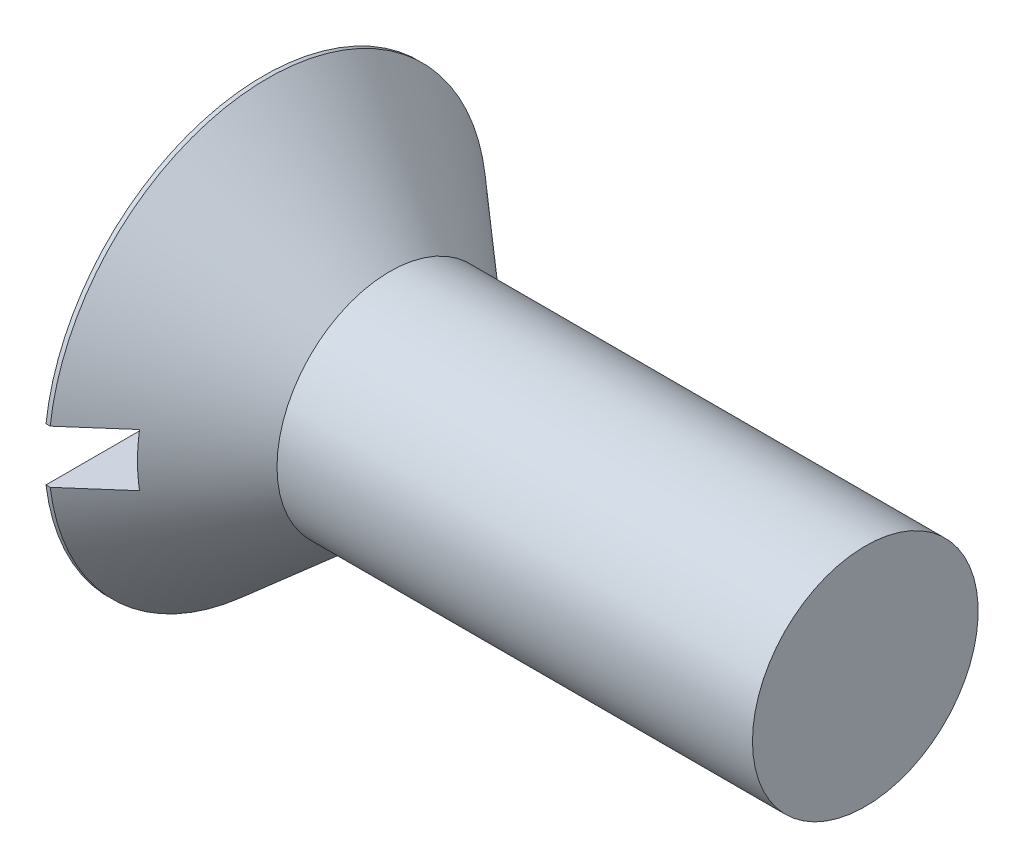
from build123d import *

# Parameters (mm, degrees)
SKETCH6_W  = 18.4912
SKETCH6_H  = 2.2352
SLOT_DEPTH = 2.1844


with BuildPart() as part:
    # BodySke → Base-Revolve (revolve)
    with BuildSketch(Plane.XY, mode=Mode.PRIVATE) as base_revolve_sk:
        Polygon((0, 0), (0, 9.2456), (0.176783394, 9.2456), (5.334, 4.7625), (25.4, 4.7625), (25.4, 0), align=None)
    revolve(base_revolve_sk.sketch.rotate(Axis((-6.35, 0, 0), (1, 0, 0)), 90), axis=Axis((-6.35, 0, 0), (1, 0, 0)))

    # Sketch6 → Slot (cut)
    with BuildSketch(Plane.ZY):
        Rectangle(SKETCH6_W, SKETCH6_H)
    extrude(amount=-SLOT_DEPTH, mode=Mode.SUBTRACT)


solid = part.part
